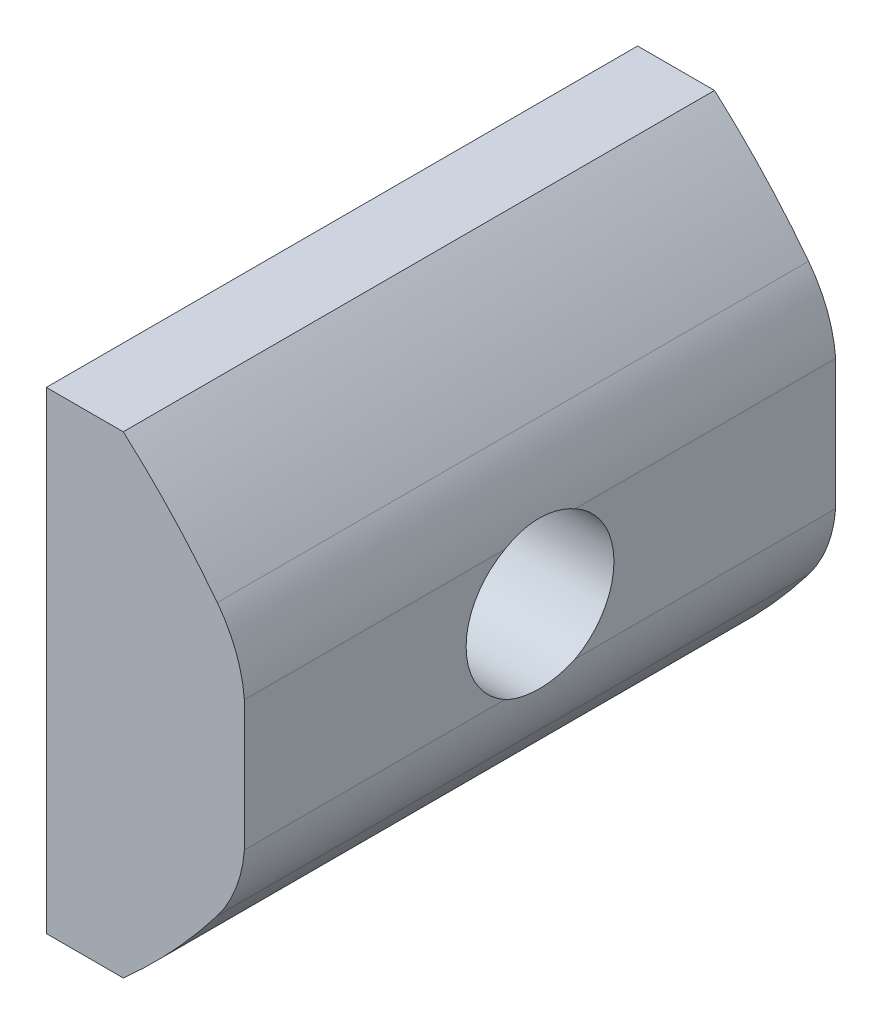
from build123d import *

# Parameters (mm, degrees)
EXTRUSION1_DEPTH      = 10
CHANFREIN1_SIZE       = 0.3
TROU_TARAUD_M6X1_01_D = 5


with BuildPart() as part:
    # Esquisse1 → Extrusion1 (new, symmetric)
    with BuildSketch(Plane.XY):
        with BuildLine():
            Line((4, 2.2), (4, -2.2))
            ThreePointArc((4, -2.2), (3.714708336, -3.459776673), (3.08330765, -4.586613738))
            ThreePointArc((3.08330765, -4.586613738), (1.574422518, -6.369191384), (-0.097337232, -8))
            Line((-0.097337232, -8), (-3, -8))
            Line((-3, -8), (-3, 8))
            Line((-3, 8), (-0.097337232, 8))
            ThreePointArc((-0.097337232, 8), (1.574422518, 6.369191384), (3.08330765, 4.586613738))
            ThreePointArc((3.08330765, 4.586613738), (3.714708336, 3.459776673), (4, 2.2))
        make_face()
    extrude(amount=EXTRUSION1_DEPTH, both=True)

    # Chanfrein1
    chanfrein1_edges = [part.edges().sort_by_distance(p)[0] for p in [
        (-3, 0, 10),
        (-3, 8, 0),
        (-3, 0, -10),
        (-3, -8, 0),
    ]]
    chamfer(chanfrein1_edges, length=CHANFREIN1_SIZE)

    # Trou taraud_ M6x1.01 (through all)
    with Locations(Plane.ZY.offset(3)):
        with Locations((0, 0)):
            Hole(TROU_TARAUD_M6X1_01_D / 2)


solid = part.part
